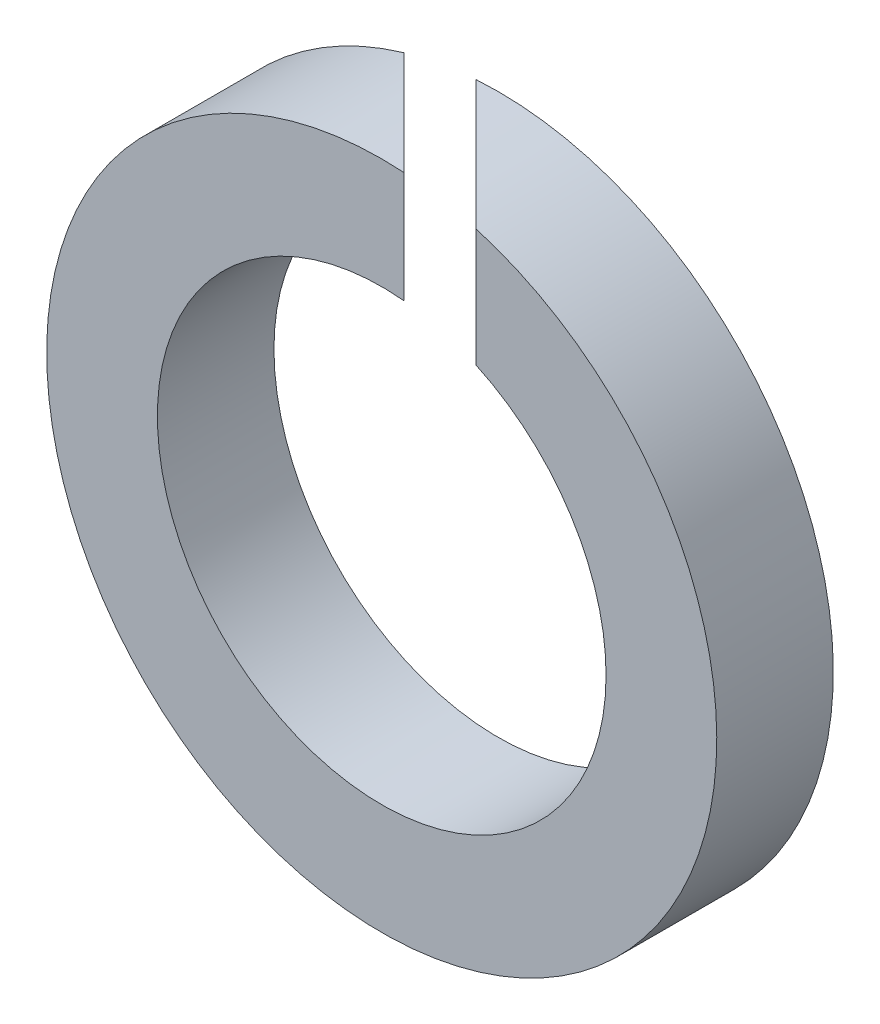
from build123d import *

# Parameters (mm, degrees)
ESQUISSE1_R             = 11.5
BASE_EXTRUSION_DEPTH    = 4
ESQUISSE2_R             = 7
ENL_V_MAT_EXTRU_1_DEPTH = 17.748134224
ENL_V_MAT_EXTRU_2_DEPTH = 17.748134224
ESQUISSE4_R             = 7.7
ENL_V_MAT_EXTRU_3_DEPTH = 17.748134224


with BuildPart() as part:
    # Esquisse1 → Base-Extrusion (new body)
    with BuildSketch(Plane.XY):
        Circle(ESQUISSE1_R)
    extrude(amount=BASE_EXTRUSION_DEPTH)

    # Esquisse2 → Enl_v. mat.-Extru.1 (cut, through all)
    with BuildSketch(Plane.XY.offset(4)):
        Circle(ESQUISSE2_R)
    extrude(amount=-ENL_V_MAT_EXTRU_1_DEPTH, mode=Mode.SUBTRACT)

    # Esquisse3 → Enl_v. mat.-Extru.2 (cut, through all)
    with BuildSketch(Plane(origin=(0, 0, 0), x_dir=(1, 0, 0), z_dir=(0, 1, 0))):
        Polygon((-3.237436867, 0), (0.762563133, -4), (3.237436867, -4), (-0.762563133, 0), align=None)
    extrude(amount=ENL_V_MAT_EXTRU_2_DEPTH, mode=Mode.SUBTRACT)

    # Esquisse4 → Enl_v. mat.-Extru.3 (cut, through all)
    with BuildSketch(Plane(origin=(0, 0, 0), x_dir=(-1, 0, 0), z_dir=(0, 0, -1))):
        Circle(ESQUISSE4_R)
    extrude(amount=-ENL_V_MAT_EXTRU_3_DEPTH, mode=Mode.SUBTRACT)


solid = part.part
